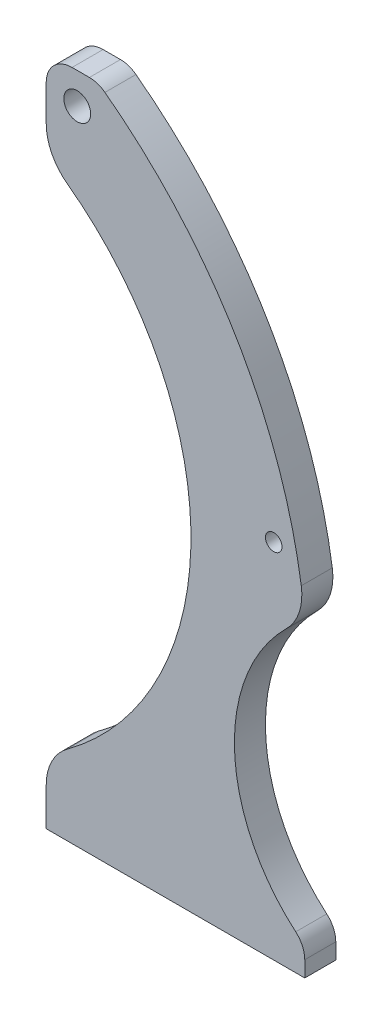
ISO-10303-21;
HEADER;
FILE_DESCRIPTION(('STEP AP214'),'2;1');
FILE_NAME('part.step','',(''),(''),'','','');
FILE_SCHEMA(('AUTOMOTIVE_DESIGN { 1 0 10303 214 1 1 1 1 }'));
ENDSEC;
DATA;
#1=APPLICATION_CONTEXT('core data for automotive mechanical design processes');
#2=APPLICATION_PROTOCOL_DEFINITION('international standard','automotive_design',2000,#1);
#3=PRODUCT_CONTEXT('',#1,'mechanical');
#4=PRODUCT('Part','Part','',(#3));
#5=PRODUCT_RELATED_PRODUCT_CATEGORY('part','',(#4));
#6=PRODUCT_DEFINITION_FORMATION('','',#4);
#7=PRODUCT_DEFINITION_CONTEXT('part definition',#1,'design');
#8=PRODUCT_DEFINITION('design','',#6,#7);
#9=PRODUCT_DEFINITION_SHAPE('','',#8);
#10=(LENGTH_UNIT() NAMED_UNIT(*) SI_UNIT(.MILLI.,.METRE.));
#11=(NAMED_UNIT(*) PLANE_ANGLE_UNIT() SI_UNIT($,.RADIAN.));
#12=(NAMED_UNIT(*) SI_UNIT($,.STERADIAN.) SOLID_ANGLE_UNIT());
#13=UNCERTAINTY_MEASURE_WITH_UNIT(LENGTH_MEASURE(1.E-05),#10,'distance_accuracy_value','');
#14=(GEOMETRIC_REPRESENTATION_CONTEXT(3) GLOBAL_UNCERTAINTY_ASSIGNED_CONTEXT((#13)) GLOBAL_UNIT_ASSIGNED_CONTEXT((#10,
#11,#12)) REPRESENTATION_CONTEXT('',''));
#15=CARTESIAN_POINT('',(0.,0.,0.));
#16=DIRECTION('',(0.,0.,1.));
#17=DIRECTION('',(1.,0.,0.));
#18=AXIS2_PLACEMENT_3D('',#15,#16,#17);
#19=CARTESIAN_POINT('',(22.062235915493,53.975,6.));
#20=DIRECTION('',(-1.,0.,0.));
#21=DIRECTION('',(0.,-1.,0.));
#22=AXIS2_PLACEMENT_3D('',#19,#20,#21);
#23=PLANE('',#22);
#24=DIRECTION('',(0.,1.,0.));
#25=VECTOR('',#24,1.);
#26=CARTESIAN_POINT('',(22.062235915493,53.975,0.));
#27=LINE('',#26,#25);
#28=CARTESIAN_POINT('',(22.062235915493,-76.025,0.));
#29=VERTEX_POINT('',#28);
#30=CARTESIAN_POINT('',(22.062235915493,-72.9630040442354,0.));
#31=VERTEX_POINT('',#30);
#32=EDGE_CURVE('E146',#29,#31,#27,.T.);
#33=ORIENTED_EDGE('',*,*,#32,.T.);
#34=DIRECTION('',(0.,0.,1.));
#35=VECTOR('',#34,1.);
#36=CARTESIAN_POINT('',(22.062235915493,-72.9630040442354,6.));
#37=LINE('',#36,#35);
#38=CARTESIAN_POINT('',(22.062235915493,-72.9630040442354,6.));
#39=VERTEX_POINT('',#38);
#40=EDGE_CURVE('E196',#31,#39,#37,.T.);
#41=ORIENTED_EDGE('',*,*,#40,.T.);
#42=DIRECTION('',(0.,1.,0.));
#43=VECTOR('',#42,1.);
#44=CARTESIAN_POINT('',(22.062235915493,53.975,6.));
#45=LINE('',#44,#43);
#46=CARTESIAN_POINT('',(22.062235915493,-76.025,6.));
#47=VERTEX_POINT('',#46);
#48=EDGE_CURVE('E260',#47,#39,#45,.T.);
#49=ORIENTED_EDGE('',*,*,#48,.F.);
#50=DIRECTION('',(0.,0.,-1.));
#51=VECTOR('',#50,1.);
#52=CARTESIAN_POINT('',(22.062235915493,-76.025,6.));
#53=LINE('',#52,#51);
#54=EDGE_CURVE('E155',#47,#29,#53,.T.);
#55=ORIENTED_EDGE('',*,*,#54,.T.);
#56=EDGE_LOOP('',(#33,#41,#49,#55));
#57=FACE_BOUND('',#56,.T.);
#58=ADVANCED_FACE('F29',(#57),#23,.F.);
#59=CARTESIAN_POINT('',(-27.937764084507,53.975,6.));
#60=DIRECTION('',(1.,0.,0.));
#61=DIRECTION('',(0.,1.,0.));
#62=AXIS2_PLACEMENT_3D('',#59,#60,#61);
#63=PLANE('',#62);
#64=DIRECTION('',(0.,-1.,0.));
#65=VECTOR('',#64,1.);
#66=CARTESIAN_POINT('',(-27.937764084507,53.975,6.));
#67=LINE('',#66,#65);
#68=CARTESIAN_POINT('',(-27.937764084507,48.975,6.));
#69=VERTEX_POINT('',#68);
#70=CARTESIAN_POINT('',(-27.937764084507,42.0916572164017,6.));
#71=VERTEX_POINT('',#70);
#72=EDGE_CURVE('E257',#69,#71,#67,.T.);
#73=ORIENTED_EDGE('',*,*,#72,.F.);
#74=DIRECTION('',(0.,0.,-1.));
#75=VECTOR('',#74,1.);
#76=CARTESIAN_POINT('',(-27.937764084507,48.975,6.));
#77=LINE('',#76,#75);
#78=CARTESIAN_POINT('',(-27.937764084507,48.975,0.));
#79=VERTEX_POINT('',#78);
#80=EDGE_CURVE('E11',#69,#79,#77,.T.);
#81=ORIENTED_EDGE('',*,*,#80,.T.);
#82=DIRECTION('',(0.,-1.,0.));
#83=VECTOR('',#82,1.);
#84=CARTESIAN_POINT('',(-27.937764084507,53.975,0.));
#85=LINE('',#84,#83);
#86=CARTESIAN_POINT('',(-27.937764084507,42.0916572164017,0.));
#87=VERTEX_POINT('',#86);
#88=EDGE_CURVE('E138',#79,#87,#85,.T.);
#89=ORIENTED_EDGE('',*,*,#88,.T.);
#90=DIRECTION('',(0.,0.,1.));
#91=VECTOR('',#90,1.);
#92=CARTESIAN_POINT('',(-27.937764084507,42.0916572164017,6.));
#93=LINE('',#92,#91);
#94=EDGE_CURVE('E187',#87,#71,#93,.T.);
#95=ORIENTED_EDGE('',*,*,#94,.T.);
#96=EDGE_LOOP('',(#73,#81,#89,#95));
#97=FACE_BOUND('',#96,.T.);
#98=ADVANCED_FACE('F267',(#97),#63,.F.);
#99=CARTESIAN_POINT('',(-27.937764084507,-68.7140359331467,6.));
#100=VERTEX_POINT('',#99);
#101=CARTESIAN_POINT('',(-27.937764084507,-76.025,6.));
#102=VERTEX_POINT('',#101);
#103=EDGE_CURVE('E223',#100,#102,#67,.T.);
#104=ORIENTED_EDGE('',*,*,#103,.F.);
#105=DIRECTION('',(0.,0.,1.));
#106=VECTOR('',#105,1.);
#107=CARTESIAN_POINT('',(-27.937764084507,-68.7140359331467,6.));
#108=LINE('',#107,#106);
#109=CARTESIAN_POINT('',(-27.937764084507,-68.7140359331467,0.));
#110=VERTEX_POINT('',#109);
#111=EDGE_CURVE('E136',#100,#110,#108,.F.);
#112=ORIENTED_EDGE('',*,*,#111,.T.);
#113=CARTESIAN_POINT('',(-27.937764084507,-76.025,0.));
#114=VERTEX_POINT('',#113);
#115=EDGE_CURVE('E130',#110,#114,#85,.T.);
#116=ORIENTED_EDGE('',*,*,#115,.T.);
#117=DIRECTION('',(0.,0.,-1.));
#118=VECTOR('',#117,1.);
#119=CARTESIAN_POINT('',(-27.937764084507,-76.025,6.));
#120=LINE('',#119,#118);
#121=EDGE_CURVE('E134',#102,#114,#120,.T.);
#122=ORIENTED_EDGE('',*,*,#121,.F.);
#123=EDGE_LOOP('',(#104,#112,#116,#122));
#124=FACE_BOUND('',#123,.T.);
#125=ADVANCED_FACE('F31',(#124),#63,.F.);
#126=CARTESIAN_POINT('',(-27.937764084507,-76.025,6.));
#127=DIRECTION('',(0.,1.,0.));
#128=DIRECTION('',(0.,0.,1.));
#129=AXIS2_PLACEMENT_3D('',#126,#127,#128);
#130=PLANE('',#129);
#131=DIRECTION('',(1.,0.,0.));
#132=VECTOR('',#131,1.);
#133=CARTESIAN_POINT('',(-27.937764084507,-76.025,0.));
#134=LINE('',#133,#132);
#135=EDGE_CURVE('E142',#114,#29,#134,.T.);
#136=ORIENTED_EDGE('',*,*,#135,.T.);
#137=ORIENTED_EDGE('',*,*,#54,.F.);
#138=DIRECTION('',(1.,0.,0.));
#139=VECTOR('',#138,1.);
#140=CARTESIAN_POINT('',(-27.937764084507,-76.025,6.));
#141=LINE('',#140,#139);
#142=EDGE_CURVE('E153',#102,#47,#141,.T.);
#143=ORIENTED_EDGE('',*,*,#142,.F.);
#144=ORIENTED_EDGE('',*,*,#121,.T.);
#145=EDGE_LOOP('',(#136,#137,#143,#144));
#146=FACE_BOUND('',#145,.T.);
#147=ADVANCED_FACE('F152',(#146),#130,.F.);
#148=CARTESIAN_POINT('',(-27.937764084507,53.975,6.));
#149=DIRECTION('',(0.,-1.,0.));
#150=DIRECTION('',(0.,0.,-1.));
#151=AXIS2_PLACEMENT_3D('',#148,#149,#150);
#152=PLANE('',#151);
#153=DIRECTION('',(-1.,0.,0.));
#154=VECTOR('',#153,1.);
#155=CARTESIAN_POINT('',(-27.937764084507,53.975,6.));
#156=LINE('',#155,#154);
#157=CARTESIAN_POINT('',(-19.5825176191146,53.975,6.));
#158=VERTEX_POINT('',#157);
#159=CARTESIAN_POINT('',(-22.937764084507,53.975,6.));
#160=VERTEX_POINT('',#159);
#161=EDGE_CURVE('E160',#158,#160,#156,.T.);
#162=ORIENTED_EDGE('',*,*,#161,.F.);
#163=DIRECTION('',(0.,0.,1.));
#164=VECTOR('',#163,1.);
#165=CARTESIAN_POINT('',(-19.5825176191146,53.975,6.));
#166=LINE('',#165,#164);
#167=CARTESIAN_POINT('',(-19.5825176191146,53.975,0.));
#168=VERTEX_POINT('',#167);
#169=EDGE_CURVE('E37',#158,#168,#166,.F.);
#170=ORIENTED_EDGE('',*,*,#169,.T.);
#171=DIRECTION('',(-1.,0.,0.));
#172=VECTOR('',#171,1.);
#173=CARTESIAN_POINT('',(-27.937764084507,53.975,0.));
#174=LINE('',#173,#172);
#175=CARTESIAN_POINT('',(-22.937764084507,53.975,0.));
#176=VERTEX_POINT('',#175);
#177=EDGE_CURVE('E219',#168,#176,#174,.T.);
#178=ORIENTED_EDGE('',*,*,#177,.T.);
#179=DIRECTION('',(0.,0.,-1.));
#180=VECTOR('',#179,1.);
#181=CARTESIAN_POINT('',(-22.937764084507,53.975,6.));
#182=LINE('',#181,#180);
#183=EDGE_CURVE('E214',#176,#160,#182,.F.);
#184=ORIENTED_EDGE('',*,*,#183,.T.);
#185=EDGE_LOOP('',(#162,#170,#178,#184));
#186=FACE_BOUND('',#185,.T.);
#187=ADVANCED_FACE('F218',(#186),#152,.F.);
#188=CARTESIAN_POINT('',(-27.937764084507,-76.025,6.));
#189=DIRECTION('',(0.,0.,1.));
#190=DIRECTION('',(1.,0.,0.));
#191=AXIS2_PLACEMENT_3D('',#188,#189,#190);
#192=PLANE('',#191);
#193=ORIENTED_EDGE('',*,*,#48,.T.);
#194=CARTESIAN_POINT('',(17.062235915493,-72.9630040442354,6.));
#195=DIRECTION('',(0.,0.,1.));
#196=DIRECTION('',(1.,0.,0.));
#197=AXIS2_PLACEMENT_3D('',#194,#195,#196);
#198=CIRCLE('',#197,5.);
#199=CARTESIAN_POINT('',(20.3144978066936,-69.1652688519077,6.));
#200=VERTEX_POINT('',#199);
#201=EDGE_CURVE('E203',#39,#200,#198,.T.);
#202=ORIENTED_EDGE('',*,*,#201,.T.);
#203=CARTESIAN_POINT('',(42.3826716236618,-43.3957942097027,6.));
#204=DIRECTION('',(0.,0.,1.));
#205=DIRECTION('',(1.,0.,0.));
#206=AXIS2_PLACEMENT_3D('',#203,#204,#205);
#207=CIRCLE('',#206,33.927424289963);
#208=CARTESIAN_POINT('',(18.5298926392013,-19.2687335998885,6.));
#209=VERTEX_POINT('',#208);
#210=EDGE_CURVE('E237',#209,#200,#207,.T.);
#211=ORIENTED_EDGE('',*,*,#210,.F.);
#212=CARTESIAN_POINT('',(11.499362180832,-12.1573595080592,6.));
#213=DIRECTION('',(0.,0.,1.));
#214=DIRECTION('',(1.,0.,0.));
#215=AXIS2_PLACEMENT_3D('',#212,#213,#214);
#216=CIRCLE('',#215,10.);
#217=CARTESIAN_POINT('',(21.3880484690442,-10.6694470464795,6.));
#218=VERTEX_POINT('',#217);
#219=EDGE_CURVE('E172',#209,#218,#216,.T.);
#220=ORIENTED_EDGE('',*,*,#219,.T.);
#221=CARTESIAN_POINT('',(-75.3284238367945,-25.2220013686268,6.));
#222=DIRECTION('',(0.,0.,-1.));
#223=DIRECTION('',(-1.,0.,0.));
#224=AXIS2_PLACEMENT_3D('',#221,#222,#223);
#225=CIRCLE('',#224,97.8051780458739);
#226=CARTESIAN_POINT('',(-16.5791342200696,52.9724602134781,6.));
#227=VERTEX_POINT('',#226);
#228=EDGE_CURVE('E230',#227,#218,#225,.T.);
#229=ORIENTED_EDGE('',*,*,#228,.F.);
#230=CARTESIAN_POINT('',(-19.5825176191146,48.975,6.));
#231=DIRECTION('',(0.,0.,1.));
#232=DIRECTION('',(1.,0.,0.));
#233=AXIS2_PLACEMENT_3D('',#230,#231,#232);
#234=CIRCLE('',#233,5.);
#235=EDGE_CURVE('E201',#227,#158,#234,.T.);
#236=ORIENTED_EDGE('',*,*,#235,.T.);
#237=ORIENTED_EDGE('',*,*,#161,.T.);
#238=CARTESIAN_POINT('',(-22.937764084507,48.975,6.));
#239=DIRECTION('',(0.,0.,1.));
#240=DIRECTION('',(1.,0.,0.));
#241=AXIS2_PLACEMENT_3D('',#238,#239,#240);
#242=CIRCLE('',#241,5.);
#243=EDGE_CURVE('E199',#160,#69,#242,.T.);
#244=ORIENTED_EDGE('',*,*,#243,.T.);
#245=ORIENTED_EDGE('',*,*,#72,.T.);
#246=CARTESIAN_POINT('',(-17.937764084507,42.0916572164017,6.));
#247=DIRECTION('',(0.,0.,1.));
#248=DIRECTION('',(1.,0.,0.));
#249=AXIS2_PLACEMENT_3D('',#246,#247,#248);
#250=CIRCLE('',#249,10.);
#251=CARTESIAN_POINT('',(-23.8712225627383,34.0421808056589,6.));
#252=VERTEX_POINT('',#251);
#253=EDGE_CURVE('E175',#71,#252,#250,.T.);
#254=ORIENTED_EDGE('',*,*,#253,.T.);
#255=CARTESIAN_POINT('',(-58.7765060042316,-13.3111893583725,6.));
#256=DIRECTION('',(0.,0.,1.));
#257=DIRECTION('',(1.,0.,0.));
#258=AXIS2_PLACEMENT_3D('',#255,#256,#257);
#259=CIRCLE('',#258,58.8278886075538);
#260=CARTESIAN_POINT('',(-23.8712225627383,-60.6645595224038,6.));
#261=VERTEX_POINT('',#260);
#262=EDGE_CURVE('E240',#261,#252,#259,.T.);
#263=ORIENTED_EDGE('',*,*,#262,.F.);
#264=CARTESIAN_POINT('',(-17.937764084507,-68.7140359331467,6.));
#265=DIRECTION('',(0.,0.,1.));
#266=DIRECTION('',(1.,0.,0.));
#267=AXIS2_PLACEMENT_3D('',#264,#265,#266);
#268=CIRCLE('',#267,10.);
#269=EDGE_CURVE('E177',#261,#100,#268,.T.);
#270=ORIENTED_EDGE('',*,*,#269,.T.);
#271=ORIENTED_EDGE('',*,*,#103,.T.);
#272=ORIENTED_EDGE('',*,*,#142,.T.);
#273=EDGE_LOOP('',(#193,#202,#211,#220,#229,#236,#237,#244,#245,#254,#263,#270,#271,#272));
#274=FACE_BOUND('',#273,.T.);
#275=CARTESIAN_POINT('',(16.062235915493,-6.025,6.));
#276=DIRECTION('',(0.,0.,1.));
#277=DIRECTION('',(1.,0.,0.));
#278=AXIS2_PLACEMENT_3D('',#275,#276,#277);
#279=CIRCLE('',#278,1.6);
#280=CARTESIAN_POINT('',(17.662235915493,-6.025,6.));
#281=VERTEX_POINT('',#280);
#282=EDGE_CURVE('E245',#281,#281,#279,.T.);
#283=ORIENTED_EDGE('',*,*,#282,.F.);
#284=EDGE_LOOP('',(#283));
#285=FACE_BOUND('',#284,.T.);
#286=CARTESIAN_POINT('',(-21.937764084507,47.975,6.));
#287=DIRECTION('',(0.,0.,1.));
#288=DIRECTION('',(1.,0.,0.));
#289=AXIS2_PLACEMENT_3D('',#286,#287,#288);
#290=CIRCLE('',#289,2.6);
#291=CARTESIAN_POINT('',(-19.337764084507,47.975,6.));
#292=VERTEX_POINT('',#291);
#293=EDGE_CURVE('E251',#292,#292,#290,.T.);
#294=ORIENTED_EDGE('',*,*,#293,.F.);
#295=EDGE_LOOP('',(#294));
#296=FACE_BOUND('',#295,.T.);
#297=ADVANCED_FACE('F233',(#274,#285,#296),#192,.T.);
#298=CARTESIAN_POINT('',(-27.937764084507,-76.025,0.));
#299=DIRECTION('',(0.,0.,1.));
#300=DIRECTION('',(1.,0.,0.));
#301=AXIS2_PLACEMENT_3D('',#298,#299,#300);
#302=PLANE('',#301);
#303=CARTESIAN_POINT('',(16.062235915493,-6.025,0.));
#304=DIRECTION('',(0.,0.,1.));
#305=DIRECTION('',(1.,0.,0.));
#306=AXIS2_PLACEMENT_3D('',#303,#304,#305);
#307=CIRCLE('',#306,1.6);
#308=CARTESIAN_POINT('',(17.662235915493,-6.025,0.));
#309=VERTEX_POINT('',#308);
#310=EDGE_CURVE('E248',#309,#309,#307,.T.);
#311=ORIENTED_EDGE('',*,*,#310,.T.);
#312=EDGE_LOOP('',(#311));
#313=FACE_BOUND('',#312,.T.);
#314=CARTESIAN_POINT('',(-21.937764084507,47.975,0.));
#315=DIRECTION('',(0.,0.,1.));
#316=DIRECTION('',(1.,0.,0.));
#317=AXIS2_PLACEMENT_3D('',#314,#315,#316);
#318=CIRCLE('',#317,2.6);
#319=CARTESIAN_POINT('',(-19.337764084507,47.975,0.));
#320=VERTEX_POINT('',#319);
#321=EDGE_CURVE('E139',#320,#320,#318,.T.);
#322=ORIENTED_EDGE('',*,*,#321,.T.);
#323=EDGE_LOOP('',(#322));
#324=FACE_BOUND('',#323,.T.);
#325=CARTESIAN_POINT('',(42.3826716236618,-43.3957942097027,0.));
#326=DIRECTION('',(0.,0.,1.));
#327=DIRECTION('',(1.,0.,0.));
#328=AXIS2_PLACEMENT_3D('',#325,#326,#327);
#329=CIRCLE('',#328,33.927424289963);
#330=CARTESIAN_POINT('',(18.5298926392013,-19.2687335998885,0.));
#331=VERTEX_POINT('',#330);
#332=CARTESIAN_POINT('',(20.3144978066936,-69.1652688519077,0.));
#333=VERTEX_POINT('',#332);
#334=EDGE_CURVE('E158',#331,#333,#329,.T.);
#335=ORIENTED_EDGE('',*,*,#334,.T.);
#336=CARTESIAN_POINT('',(17.062235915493,-72.9630040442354,0.));
#337=DIRECTION('',(0.,0.,1.));
#338=DIRECTION('',(1.,0.,0.));
#339=AXIS2_PLACEMENT_3D('',#336,#337,#338);
#340=CIRCLE('',#339,5.);
#341=EDGE_CURVE('E209',#333,#31,#340,.F.);
#342=ORIENTED_EDGE('',*,*,#341,.T.);
#343=ORIENTED_EDGE('',*,*,#32,.F.);
#344=ORIENTED_EDGE('',*,*,#135,.F.);
#345=ORIENTED_EDGE('',*,*,#115,.F.);
#346=CARTESIAN_POINT('',(-17.937764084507,-68.7140359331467,0.));
#347=DIRECTION('',(0.,0.,1.));
#348=DIRECTION('',(1.,0.,0.));
#349=AXIS2_PLACEMENT_3D('',#346,#347,#348);
#350=CIRCLE('',#349,10.);
#351=CARTESIAN_POINT('',(-23.8712225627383,-60.6645595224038,0.));
#352=VERTEX_POINT('',#351);
#353=EDGE_CURVE('E185',#110,#352,#350,.F.);
#354=ORIENTED_EDGE('',*,*,#353,.T.);
#355=CARTESIAN_POINT('',(-58.7765060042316,-13.3111893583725,0.));
#356=DIRECTION('',(0.,0.,1.));
#357=DIRECTION('',(1.,0.,0.));
#358=AXIS2_PLACEMENT_3D('',#355,#356,#357);
#359=CIRCLE('',#358,58.8278886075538);
#360=CARTESIAN_POINT('',(-23.8712225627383,34.0421808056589,0.));
#361=VERTEX_POINT('',#360);
#362=EDGE_CURVE('E154',#352,#361,#359,.T.);
#363=ORIENTED_EDGE('',*,*,#362,.T.);
#364=CARTESIAN_POINT('',(-17.937764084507,42.0916572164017,0.));
#365=DIRECTION('',(0.,0.,1.));
#366=DIRECTION('',(1.,0.,0.));
#367=AXIS2_PLACEMENT_3D('',#364,#365,#366);
#368=CIRCLE('',#367,10.);
#369=EDGE_CURVE('E182',#361,#87,#368,.F.);
#370=ORIENTED_EDGE('',*,*,#369,.T.);
#371=ORIENTED_EDGE('',*,*,#88,.F.);
#372=CARTESIAN_POINT('',(-22.937764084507,48.975,0.));
#373=DIRECTION('',(0.,0.,1.));
#374=DIRECTION('',(1.,0.,0.));
#375=AXIS2_PLACEMENT_3D('',#372,#373,#374);
#376=CIRCLE('',#375,5.);
#377=EDGE_CURVE('E50',#79,#176,#376,.F.);
#378=ORIENTED_EDGE('',*,*,#377,.T.);
#379=ORIENTED_EDGE('',*,*,#177,.F.);
#380=CARTESIAN_POINT('',(-19.5825176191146,48.975,0.));
#381=DIRECTION('',(0.,0.,1.));
#382=DIRECTION('',(1.,0.,0.));
#383=AXIS2_PLACEMENT_3D('',#380,#381,#382);
#384=CIRCLE('',#383,5.);
#385=CARTESIAN_POINT('',(-16.5791342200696,52.9724602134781,0.));
#386=VERTEX_POINT('',#385);
#387=EDGE_CURVE('E44',#168,#386,#384,.F.);
#388=ORIENTED_EDGE('',*,*,#387,.T.);
#389=CARTESIAN_POINT('',(-75.3284238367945,-25.2220013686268,0.));
#390=DIRECTION('',(0.,0.,1.));
#391=DIRECTION('',(1.,0.,0.));
#392=AXIS2_PLACEMENT_3D('',#389,#390,#391);
#393=CIRCLE('',#392,97.8051780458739);
#394=CARTESIAN_POINT('',(21.3880484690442,-10.6694470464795,0.));
#395=VERTEX_POINT('',#394);
#396=EDGE_CURVE('E165',#386,#395,#393,.F.);
#397=ORIENTED_EDGE('',*,*,#396,.T.);
#398=CARTESIAN_POINT('',(11.499362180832,-12.1573595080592,0.));
#399=DIRECTION('',(0.,0.,1.));
#400=DIRECTION('',(1.,0.,0.));
#401=AXIS2_PLACEMENT_3D('',#398,#399,#400);
#402=CIRCLE('',#401,10.);
#403=EDGE_CURVE('E180',#395,#331,#402,.F.);
#404=ORIENTED_EDGE('',*,*,#403,.T.);
#405=EDGE_LOOP('',(#335,#342,#343,#344,#345,#354,#363,#370,#371,#378,#379,#388,#397,#404));
#406=FACE_BOUND('',#405,.T.);
#407=ADVANCED_FACE('F144',(#313,#324,#406),#302,.F.);
#408=CARTESIAN_POINT('',(-21.937764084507,47.975,0.));
#409=DIRECTION('',(0.,0.,1.));
#410=DIRECTION('',(1.,0.,0.));
#411=AXIS2_PLACEMENT_3D('',#408,#409,#410);
#412=CYLINDRICAL_SURFACE('',#411,2.6);
#413=ORIENTED_EDGE('',*,*,#321,.F.);
#414=EDGE_LOOP('',(#413));
#415=FACE_BOUND('',#414,.T.);
#416=ORIENTED_EDGE('',*,*,#293,.T.);
#417=EDGE_LOOP('',(#416));
#418=FACE_BOUND('',#417,.T.);
#419=ADVANCED_FACE('F374',(#415,#418),#412,.F.);
#420=CARTESIAN_POINT('',(16.062235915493,-6.025,0.));
#421=DIRECTION('',(0.,0.,1.));
#422=DIRECTION('',(1.,0.,0.));
#423=AXIS2_PLACEMENT_3D('',#420,#421,#422);
#424=CYLINDRICAL_SURFACE('',#423,1.6);
#425=ORIENTED_EDGE('',*,*,#310,.F.);
#426=EDGE_LOOP('',(#425));
#427=FACE_BOUND('',#426,.T.);
#428=ORIENTED_EDGE('',*,*,#282,.T.);
#429=EDGE_LOOP('',(#428));
#430=FACE_BOUND('',#429,.T.);
#431=ADVANCED_FACE('F322',(#427,#430),#424,.F.);
#432=CARTESIAN_POINT('',(-58.7765060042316,-13.3111893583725,-14.));
#433=DIRECTION('',(0.,0.,1.));
#434=DIRECTION('',(1.,0.,0.));
#435=AXIS2_PLACEMENT_3D('',#432,#433,#434);
#436=CYLINDRICAL_SURFACE('',#435,58.8278886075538);
#437=ORIENTED_EDGE('',*,*,#362,.F.);
#438=DIRECTION('',(0.,0.,1.));
#439=VECTOR('',#438,1.);
#440=CARTESIAN_POINT('',(-23.8712225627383,-60.6645595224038,-14.));
#441=LINE('',#440,#439);
#442=EDGE_CURVE('E169',#352,#261,#441,.T.);
#443=ORIENTED_EDGE('',*,*,#442,.T.);
#444=ORIENTED_EDGE('',*,*,#262,.T.);
#445=DIRECTION('',(0.,0.,1.));
#446=VECTOR('',#445,1.);
#447=CARTESIAN_POINT('',(-23.8712225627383,34.0421808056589,-14.));
#448=LINE('',#447,#446);
#449=EDGE_CURVE('E167',#252,#361,#448,.F.);
#450=ORIENTED_EDGE('',*,*,#449,.T.);
#451=EDGE_LOOP('',(#437,#443,#444,#450));
#452=FACE_BOUND('',#451,.T.);
#453=ADVANCED_FACE('F277',(#452),#436,.F.);
#454=CARTESIAN_POINT('',(-75.3284238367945,-25.2220013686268,-14.));
#455=DIRECTION('',(0.,0.,1.));
#456=DIRECTION('',(1.,0.,0.));
#457=AXIS2_PLACEMENT_3D('',#454,#455,#456);
#458=CYLINDRICAL_SURFACE('',#457,97.8051780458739);
#459=ORIENTED_EDGE('',*,*,#396,.F.);
#460=DIRECTION('',(0.,0.,1.));
#461=VECTOR('',#460,1.);
#462=CARTESIAN_POINT('',(-16.5791342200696,52.9724602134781,-14.));
#463=LINE('',#462,#461);
#464=EDGE_CURVE('E211',#386,#227,#463,.T.);
#465=ORIENTED_EDGE('',*,*,#464,.T.);
#466=ORIENTED_EDGE('',*,*,#228,.T.);
#467=DIRECTION('',(0.,0.,1.));
#468=VECTOR('',#467,1.);
#469=CARTESIAN_POINT('',(21.3880484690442,-10.6694470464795,-14.));
#470=LINE('',#469,#468);
#471=EDGE_CURVE('E193',#218,#395,#470,.F.);
#472=ORIENTED_EDGE('',*,*,#471,.T.);
#473=EDGE_LOOP('',(#459,#465,#466,#472));
#474=FACE_BOUND('',#473,.T.);
#475=ADVANCED_FACE('F229',(#474),#458,.T.);
#476=CARTESIAN_POINT('',(42.3826716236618,-43.3957942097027,-14.));
#477=DIRECTION('',(0.,0.,1.));
#478=DIRECTION('',(1.,0.,0.));
#479=AXIS2_PLACEMENT_3D('',#476,#477,#478);
#480=CYLINDRICAL_SURFACE('',#479,33.927424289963);
#481=ORIENTED_EDGE('',*,*,#210,.T.);
#482=DIRECTION('',(0.,0.,1.));
#483=VECTOR('',#482,1.);
#484=CARTESIAN_POINT('',(20.3144978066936,-69.1652688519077,-14.));
#485=LINE('',#484,#483);
#486=EDGE_CURVE('E205',#200,#333,#485,.F.);
#487=ORIENTED_EDGE('',*,*,#486,.T.);
#488=ORIENTED_EDGE('',*,*,#334,.F.);
#489=DIRECTION('',(0.,0.,1.));
#490=VECTOR('',#489,1.);
#491=CARTESIAN_POINT('',(18.5298926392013,-19.2687335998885,-14.));
#492=LINE('',#491,#490);
#493=EDGE_CURVE('E190',#331,#209,#492,.T.);
#494=ORIENTED_EDGE('',*,*,#493,.T.);
#495=EDGE_LOOP('',(#481,#487,#488,#494));
#496=FACE_BOUND('',#495,.T.);
#497=ADVANCED_FACE('F289',(#496),#480,.F.);
#498=CARTESIAN_POINT('',(-17.937764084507,-68.7140359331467,-14.));
#499=DIRECTION('',(0.,0.,1.));
#500=DIRECTION('',(1.,0.,0.));
#501=AXIS2_PLACEMENT_3D('',#498,#499,#500);
#502=CYLINDRICAL_SURFACE('',#501,10.);
#503=ORIENTED_EDGE('',*,*,#353,.F.);
#504=ORIENTED_EDGE('',*,*,#111,.F.);
#505=ORIENTED_EDGE('',*,*,#269,.F.);
#506=ORIENTED_EDGE('',*,*,#442,.F.);
#507=EDGE_LOOP('',(#503,#504,#505,#506));
#508=FACE_BOUND('',#507,.T.);
#509=ADVANCED_FACE('F280',(#508),#502,.T.);
#510=CARTESIAN_POINT('',(-17.937764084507,42.0916572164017,-14.));
#511=DIRECTION('',(0.,0.,1.));
#512=DIRECTION('',(1.,0.,0.));
#513=AXIS2_PLACEMENT_3D('',#510,#511,#512);
#514=CYLINDRICAL_SURFACE('',#513,10.);
#515=ORIENTED_EDGE('',*,*,#369,.F.);
#516=ORIENTED_EDGE('',*,*,#449,.F.);
#517=ORIENTED_EDGE('',*,*,#253,.F.);
#518=ORIENTED_EDGE('',*,*,#94,.F.);
#519=EDGE_LOOP('',(#515,#516,#517,#518));
#520=FACE_BOUND('',#519,.T.);
#521=ADVANCED_FACE('F274',(#520),#514,.T.);
#522=CARTESIAN_POINT('',(11.499362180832,-12.1573595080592,-14.));
#523=DIRECTION('',(0.,0.,-1.));
#524=DIRECTION('',(-1.,0.,0.));
#525=AXIS2_PLACEMENT_3D('',#522,#523,#524);
#526=CYLINDRICAL_SURFACE('',#525,10.);
#527=ORIENTED_EDGE('',*,*,#403,.F.);
#528=ORIENTED_EDGE('',*,*,#471,.F.);
#529=ORIENTED_EDGE('',*,*,#219,.F.);
#530=ORIENTED_EDGE('',*,*,#493,.F.);
#531=EDGE_LOOP('',(#527,#528,#529,#530));
#532=FACE_BOUND('',#531,.T.);
#533=ADVANCED_FACE('F294',(#532),#526,.T.);
#534=CARTESIAN_POINT('',(17.062235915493,-72.9630040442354,-14.));
#535=DIRECTION('',(0.,0.,1.));
#536=DIRECTION('',(1.,0.,0.));
#537=AXIS2_PLACEMENT_3D('',#534,#535,#536);
#538=CYLINDRICAL_SURFACE('',#537,5.);
#539=ORIENTED_EDGE('',*,*,#341,.F.);
#540=ORIENTED_EDGE('',*,*,#486,.F.);
#541=ORIENTED_EDGE('',*,*,#201,.F.);
#542=ORIENTED_EDGE('',*,*,#40,.F.);
#543=EDGE_LOOP('',(#539,#540,#541,#542));
#544=FACE_BOUND('',#543,.T.);
#545=ADVANCED_FACE('F286',(#544),#538,.T.);
#546=CARTESIAN_POINT('',(-19.5825176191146,48.975,-14.));
#547=DIRECTION('',(0.,0.,1.));
#548=DIRECTION('',(1.,0.,0.));
#549=AXIS2_PLACEMENT_3D('',#546,#547,#548);
#550=CYLINDRICAL_SURFACE('',#549,5.);
#551=ORIENTED_EDGE('',*,*,#387,.F.);
#552=ORIENTED_EDGE('',*,*,#169,.F.);
#553=ORIENTED_EDGE('',*,*,#235,.F.);
#554=ORIENTED_EDGE('',*,*,#464,.F.);
#555=EDGE_LOOP('',(#551,#552,#553,#554));
#556=FACE_BOUND('',#555,.T.);
#557=ADVANCED_FACE('F226',(#556),#550,.T.);
#558=CARTESIAN_POINT('',(-22.937764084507,48.975,6.));
#559=DIRECTION('',(0.,0.,-1.));
#560=DIRECTION('',(-1.,0.,0.));
#561=AXIS2_PLACEMENT_3D('',#558,#559,#560);
#562=CYLINDRICAL_SURFACE('',#561,5.);
#563=ORIENTED_EDGE('',*,*,#243,.F.);
#564=ORIENTED_EDGE('',*,*,#183,.F.);
#565=ORIENTED_EDGE('',*,*,#377,.F.);
#566=ORIENTED_EDGE('',*,*,#80,.F.);
#567=EDGE_LOOP('',(#563,#564,#565,#566));
#568=FACE_BOUND('',#567,.T.);
#569=ADVANCED_FACE('F265',(#568),#562,.T.);
#570=CLOSED_SHELL('',(#58,#98,#125,#147,#187,#297,#407,#419,#431,#453,#475,#497,#509,#521,#533,
#545,#557,#569));
#571=MANIFOLD_SOLID_BREP('B2',#570);
#572=ADVANCED_BREP_SHAPE_REPRESENTATION('',(#18,#571),#14);
#573=SHAPE_DEFINITION_REPRESENTATION(#9,#572);
ENDSEC;
END-ISO-10303-21;
